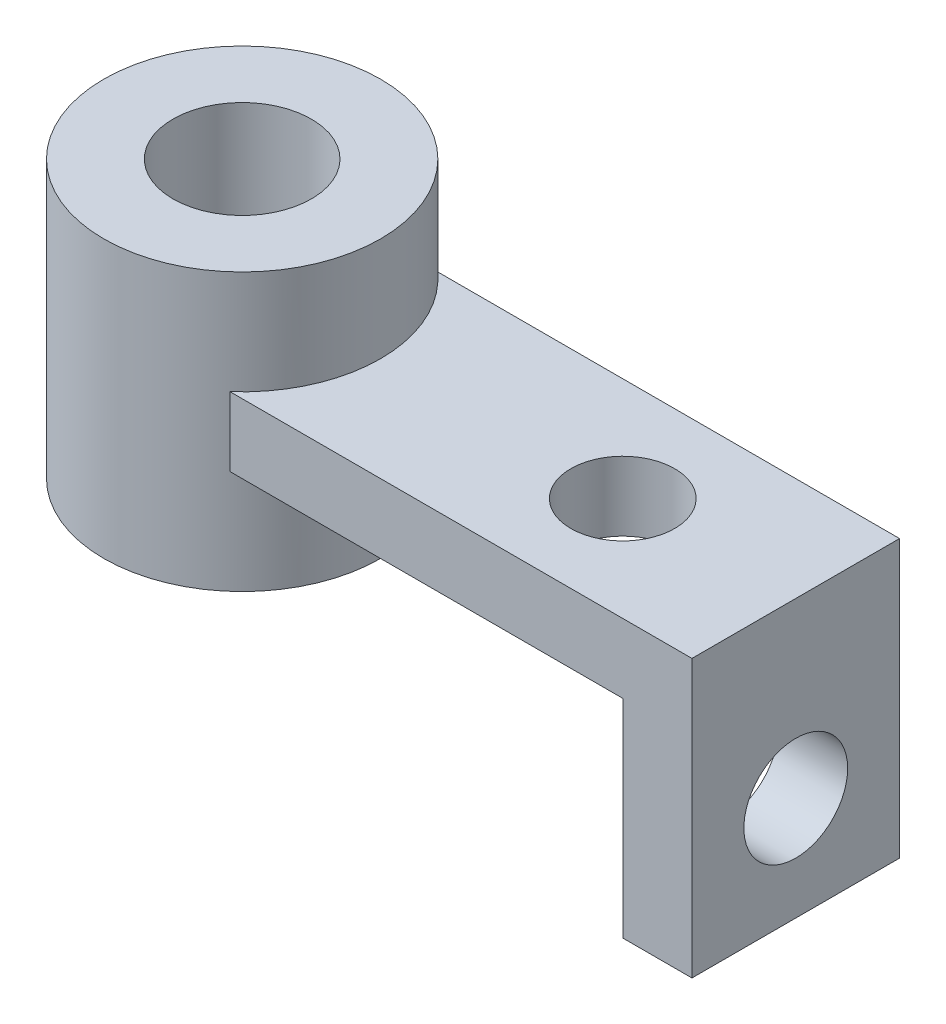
from build123d import *

# Parameters (mm, degrees)
SKETCH1_R           = 508
BOSS_EXTRUDE1_DEPTH = 1016
SKETCH2_W           = 2032
SKETCH2_H           = 762
BOSS_EXTRUDE2_DEPTH = 127
SKETCH3_W           = 254
SKETCH3_H           = 762
BOSS_EXTRUDE3_DEPTH = 762
CUT_EXTRUDE3_REACH  = 2945.004
SKETCH4_R           = 190.5
CUT_EXTRUDE4_REACH  = 2329.948
SKETCH5_R           = 190.5
SKETCH6_R           = 254
CUT_EXTRUDE5_DEPTH  = 2518.676905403


with BuildPart() as part:
    # Sketch1 → Boss-Extrude1 (new body)
    with BuildSketch(Plane(origin=(0, 0, 0), x_dir=(1, 0, 0), z_dir=(0, 1, 0))):
        with Locations(Location((0, 0, 0), (0, 0, 270))):
            Circle(SKETCH1_R)
    extrude(amount=-BOSS_EXTRUDE1_DEPTH)

    # Sketch2 → Boss-Extrude2 (add, symmetric)
    with BuildSketch(Plane(origin=(0, -508, 0), x_dir=(1, 0, 0), z_dir=(0, 1, 0))):
        with Locations((1016, 0)):
            Rectangle(SKETCH2_W, SKETCH2_H)
    extrude(amount=BOSS_EXTRUDE2_DEPTH, both=True)

    # Sketch3 → Boss-Extrude3 (add)
    with BuildSketch(Plane.XY.offset(381)):
        with Locations((1905, -1016)):
            Rectangle(SKETCH3_W, SKETCH3_H)
    extrude(amount=-BOSS_EXTRUDE3_DEPTH)

    # Sketch4 → Cut-Extrude3 (cut, up to next)
    with BuildSketch(Plane(origin=(2032, 0, 0), x_dir=(0, 0, -1), z_dir=(1, 0, 0)), mode=Mode.PRIVATE) as cut_extrude3_sk1:
        with Locations((0, -1016)):
            Circle(SKETCH4_R)
    cut_extrude3_tool1 = extrude(cut_extrude3_sk1.sketch, amount=-CUT_EXTRUDE3_REACH, mode=Mode.PRIVATE) & part.part
    add(cut_extrude3_tool1.solids().sort_by_distance((2032, -1016, 0))[0], mode=Mode.SUBTRACT)

    # Sketch5 → Cut-Extrude4 (cut, up to next)
    with BuildSketch(Plane(origin=(0, -381, 0), x_dir=(1, 0, 0), z_dir=(0, 1, 0)), mode=Mode.PRIVATE) as cut_extrude4_sk1:
        with Locations(Location((1397, 0, 0), (0, 0, 270))):
            Circle(SKETCH5_R)
    cut_extrude4_tool1 = extrude(cut_extrude4_sk1.sketch, amount=-CUT_EXTRUDE4_REACH, mode=Mode.PRIVATE) & part.part
    add(cut_extrude4_tool1.solids().sort_by_distance((1397, -381, 0))[0], mode=Mode.SUBTRACT)

    # Sketch6 → Cut-Extrude5 (cut, through all)
    with BuildSketch(Plane(origin=(0, 0, 0), x_dir=(1, 0, 0), z_dir=(0, 1, 0))):
        with Locations(Location((0, 0, 0), (0, 0, 270))):
            Circle(SKETCH6_R)
    extrude(amount=-CUT_EXTRUDE5_DEPTH, mode=Mode.SUBTRACT)


solid = part.part
